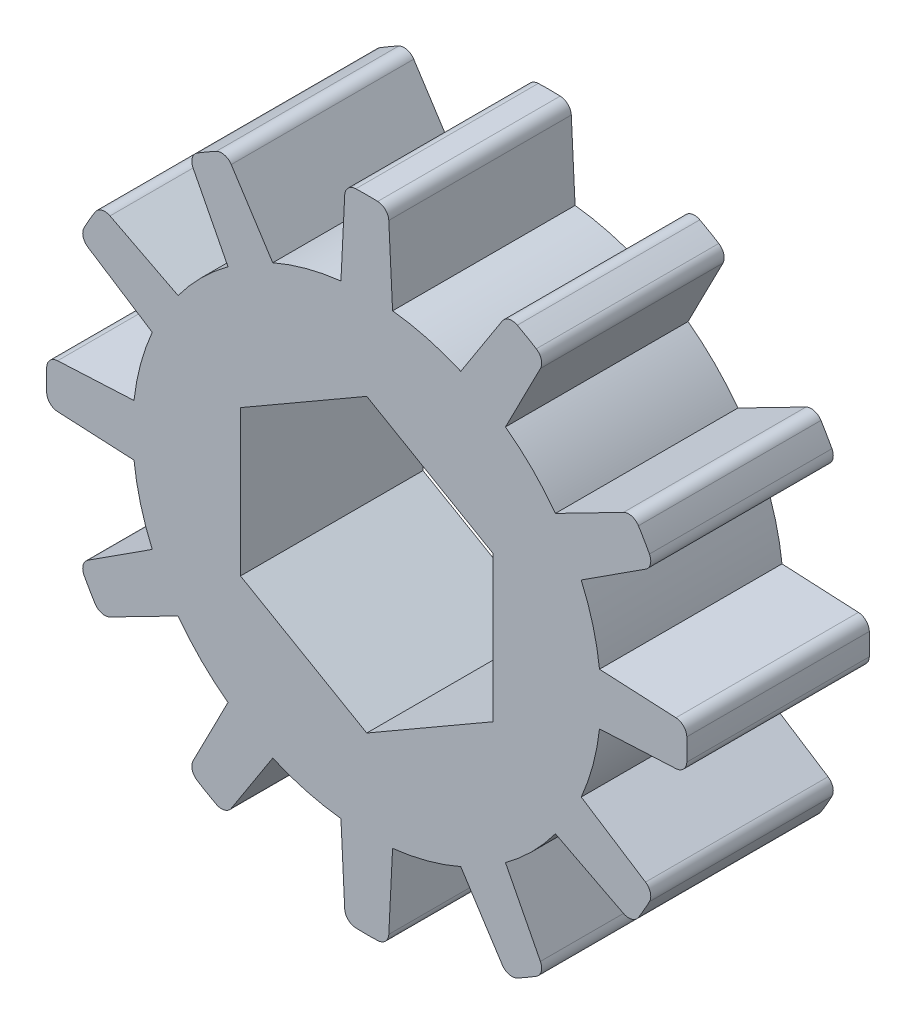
from build123d import *

# Parameters (mm, degrees)
CROQUIS1_R              = 0.5
SALIENTE_EXTRUIR1_DEPTH = 3.18
CORTAR_EXTRUIR3_DEPTH   = 9.508591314
REDONDEO1_R             = 0.2


with BuildPart() as part:
    # Croquis1 → Saliente-Extruir1 (new body)
    with BuildSketch(Plane.XY):
        with BuildLine():
            Line((0.375, 5.567875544), (0.45, 4.055600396))
            ThreePointArc((0.45, 4.055600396), (1.056108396, 3.941450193), (1.638088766, 3.737252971))
            Line((1.638088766, 3.737252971), (2.459178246, 5.009421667))
            ThreePointArc((2.459178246, 5.009421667), (2.790244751, 4.832845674), (3.108697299, 4.634421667))
            Line((3.108697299, 4.634421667), (2.41751163, 3.287252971))
            ThreePointArc((2.41751163, 3.287252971), (2.885341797, 2.885341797), (3.287252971, 2.41751163))
            Line((3.287252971, 2.41751163), (4.634421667, 3.108697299))
            ThreePointArc((4.634421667, 3.108697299), (4.832845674, 2.790244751), (5.009421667, 2.459178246))
            Line((5.009421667, 2.459178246), (3.737252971, 1.638088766))
            ThreePointArc((3.737252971, 1.638088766), (3.941450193, 1.056108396), (4.055600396, 0.45))
            Line((4.055600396, 0.45), (5.567875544, 0.375))
            ThreePointArc((5.567875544, 0.375), (5.580489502, 0), (5.567875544, -0.375))
            Line((5.567875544, -0.375), (4.055600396, -0.45))
            ThreePointArc((4.055600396, -0.45), (3.941450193, -1.056108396), (3.737252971, -1.638088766))
            Line((3.737252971, -1.638088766), (5.009421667, -2.459178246))
            ThreePointArc((5.009421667, -2.459178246), (4.832845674, -2.790244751), (4.634421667, -3.108697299))
            Line((4.634421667, -3.108697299), (3.287252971, -2.41751163))
            ThreePointArc((3.287252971, -2.41751163), (2.885341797, -2.885341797), (2.41751163, -3.287252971))
            Line((2.41751163, -3.287252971), (3.108697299, -4.634421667))
            ThreePointArc((3.108697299, -4.634421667), (2.790244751, -4.832845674), (2.459178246, -5.009421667))
            Line((2.459178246, -5.009421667), (1.638088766, -3.737252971))
            ThreePointArc((1.638088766, -3.737252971), (1.056108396, -3.941450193), (0.45, -4.055600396))
            Line((0.45, -4.055600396), (0.375, -5.567875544))
            ThreePointArc((0.375, -5.567875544), (0, -5.580489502), (-0.375, -5.567875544))
            Line((-0.375, -5.567875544), (-0.45, -4.055600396))
            ThreePointArc((-0.45, -4.055600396), (-1.056108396, -3.941450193), (-1.638088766, -3.737252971))
            Line((-1.638088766, -3.737252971), (-2.459178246, -5.009421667))
            ThreePointArc((-2.459178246, -5.009421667), (-2.790244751, -4.832845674), (-3.108697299, -4.634421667))
            Line((-3.108697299, -4.634421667), (-2.41751163, -3.287252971))
            ThreePointArc((-2.41751163, -3.287252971), (-2.885341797, -2.885341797), (-3.287252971, -2.41751163))
            Line((-3.287252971, -2.41751163), (-4.634421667, -3.108697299))
            ThreePointArc((-4.634421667, -3.108697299), (-4.832845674, -2.790244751), (-5.009421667, -2.459178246))
            Line((-5.009421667, -2.459178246), (-3.737252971, -1.638088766))
            ThreePointArc((-3.737252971, -1.638088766), (-3.941450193, -1.056108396), (-4.055600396, -0.45))
            Line((-4.055600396, -0.45), (-5.567875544, -0.375))
            ThreePointArc((-5.567875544, -0.375), (-5.580489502, 0), (-5.567875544, 0.375))
            Line((-5.567875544, 0.375), (-4.055600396, 0.45))
            ThreePointArc((-4.055600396, 0.45), (-3.941450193, 1.056108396), (-3.737252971, 1.638088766))
            Line((-3.737252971, 1.638088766), (-5.009421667, 2.459178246))
            ThreePointArc((-5.009421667, 2.459178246), (-4.832845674, 2.790244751), (-4.634421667, 3.108697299))
            Line((-4.634421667, 3.108697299), (-3.287252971, 2.41751163))
            ThreePointArc((-3.287252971, 2.41751163), (-2.885341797, 2.885341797), (-2.41751163, 3.287252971))
            Line((-2.41751163, 3.287252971), (-3.108697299, 4.634421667))
            ThreePointArc((-3.108697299, 4.634421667), (-2.790244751, 4.832845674), (-2.459178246, 5.009421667))
            Line((-2.459178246, 5.009421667), (-1.638088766, 3.737252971))
            ThreePointArc((-1.638088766, 3.737252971), (-1.056108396, 3.941450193), (-0.45, 4.055600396))
            Line((-0.45, 4.055600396), (-0.375, 5.567875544))
            ThreePointArc((-0.375, 5.567875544), (0, 5.580489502), (0.375, 5.567875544))
        make_face()
        Circle(CROQUIS1_R, mode=Mode.SUBTRACT)
    extrude(amount=SALIENTE_EXTRUIR1_DEPTH)

    # Croquis10 → Cortar-Extruir3 (cut, through all)
    with BuildSketch(Plane(origin=(0, 0, 0), x_dir=(-1, 0, 0), z_dir=(0, 0, -1))):
        Polygon((0, -2.540341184), (2.2, -1.270170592), (2.2, 1.270170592), (0, 2.540341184), (-2.2, 1.270170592), (-2.2, -1.270170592), align=None)
    extrude(amount=-CORTAR_EXTRUIR3_DEPTH, mode=Mode.SUBTRACT)

    # Redondeo1
    redondeo1_edges = [part.edges().sort_by_distance(p)[0] for p in [
        (0.375, 5.567875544, 1.59),
        (2.459178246, 5.009421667, 1.59),
        (3.108697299, 4.634421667, 1.59),
        (4.634421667, 3.108697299, 1.59),
        (5.009421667, 2.459178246, 1.59),
        (5.567875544, 0.375, 1.59),
        (5.567875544, -0.375, 1.59),
        (5.009421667, -2.459178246, 1.59),
        (4.634421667, -3.108697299, 1.59),
        (3.108697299, -4.634421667, 1.59),
        (2.459178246, -5.009421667, 1.59),
        (0.375, -5.567875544, 1.59),
        (-0.375, -5.567875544, 1.59),
        (-2.459178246, -5.009421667, 1.59),
        (-3.108697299, -4.634421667, 1.59),
        (-4.634421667, -3.108697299, 1.59),
        (-5.009421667, -2.459178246, 1.59),
        (-5.567875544, -0.375, 1.59),
        (-5.567875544, 0.375, 1.59),
        (-5.009421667, 2.459178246, 1.59),
        (-4.634421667, 3.108697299, 1.59),
        (-3.108697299, 4.634421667, 1.59),
        (-2.459178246, 5.009421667, 1.59),
        (-0.375, 5.567875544, 1.59),
    ]]
    fillet(redondeo1_edges, radius=REDONDEO1_R)


solid = part.part
